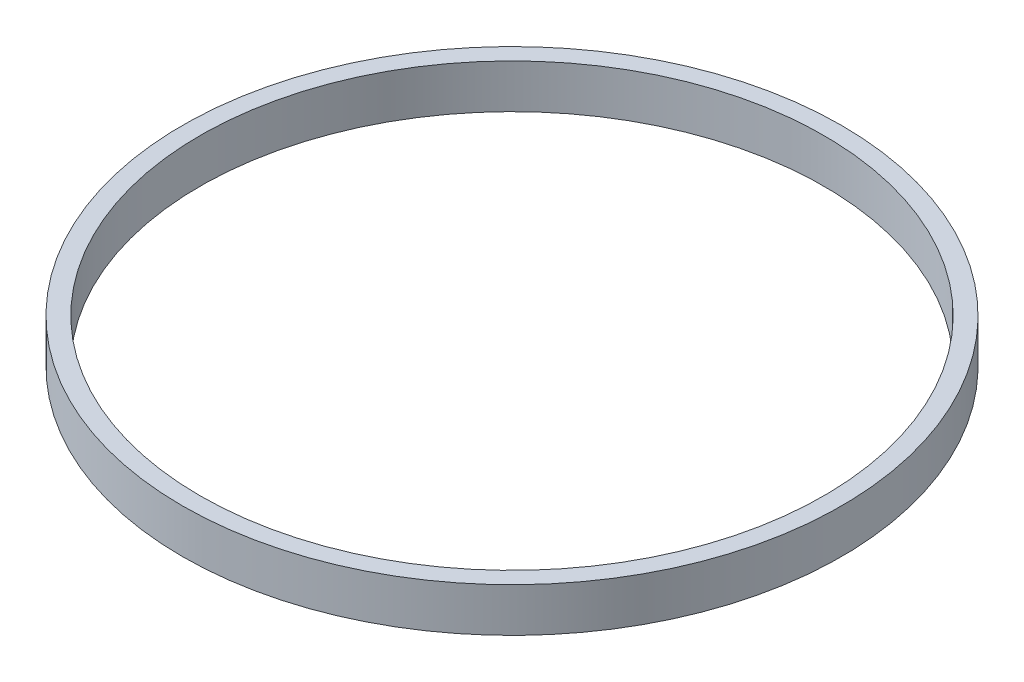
ISO-10303-21;
HEADER;
FILE_DESCRIPTION(('STEP AP214'),'2;1');
FILE_NAME('part.step','',(''),(''),'','','');
FILE_SCHEMA(('AUTOMOTIVE_DESIGN { 1 0 10303 214 1 1 1 1 }'));
ENDSEC;
DATA;
#1=APPLICATION_CONTEXT('core data for automotive mechanical design processes');
#2=APPLICATION_PROTOCOL_DEFINITION('international standard','automotive_design',2000,#1);
#3=PRODUCT_CONTEXT('',#1,'mechanical');
#4=PRODUCT('Part','Part','',(#3));
#5=PRODUCT_RELATED_PRODUCT_CATEGORY('part','',(#4));
#6=PRODUCT_DEFINITION_FORMATION('','',#4);
#7=PRODUCT_DEFINITION_CONTEXT('part definition',#1,'design');
#8=PRODUCT_DEFINITION('design','',#6,#7);
#9=PRODUCT_DEFINITION_SHAPE('','',#8);
#10=(LENGTH_UNIT() NAMED_UNIT(*) SI_UNIT(.MILLI.,.METRE.));
#11=(NAMED_UNIT(*) PLANE_ANGLE_UNIT() SI_UNIT($,.RADIAN.));
#12=(NAMED_UNIT(*) SI_UNIT($,.STERADIAN.) SOLID_ANGLE_UNIT());
#13=UNCERTAINTY_MEASURE_WITH_UNIT(LENGTH_MEASURE(1.E-05),#10,'distance_accuracy_value','');
#14=(GEOMETRIC_REPRESENTATION_CONTEXT(3) GLOBAL_UNCERTAINTY_ASSIGNED_CONTEXT((#13)) GLOBAL_UNIT_ASSIGNED_CONTEXT((#10,
#11,#12)) REPRESENTATION_CONTEXT('',''));
#15=CARTESIAN_POINT('',(0.,0.,0.));
#16=DIRECTION('',(0.,0.,1.));
#17=DIRECTION('',(1.,0.,0.));
#18=AXIS2_PLACEMENT_3D('',#15,#16,#17);
#19=CARTESIAN_POINT('',(0.,10.,0.));
#20=DIRECTION('',(0.,1.,0.));
#21=DIRECTION('',(0.,0.,1.));
#22=AXIS2_PLACEMENT_3D('',#19,#20,#21);
#23=PLANE('',#22);
#24=CARTESIAN_POINT('',(0.,10.,0.));
#25=DIRECTION('',(0.,1.,0.));
#26=DIRECTION('',(0.,0.,1.));
#27=AXIS2_PLACEMENT_3D('',#24,#25,#26);
#28=CIRCLE('',#27,75.);
#29=CARTESIAN_POINT('',(0.,10.,75.));
#30=VERTEX_POINT('',#29);
#31=EDGE_CURVE('E10',#30,#30,#28,.T.);
#32=ORIENTED_EDGE('',*,*,#31,.T.);
#33=EDGE_LOOP('',(#32));
#34=FACE_BOUND('',#33,.T.);
#35=CARTESIAN_POINT('',(0.,10.,0.));
#36=DIRECTION('',(0.,1.,0.));
#37=DIRECTION('',(0.,0.,1.));
#38=AXIS2_PLACEMENT_3D('',#35,#36,#37);
#39=CIRCLE('',#38,71.);
#40=CARTESIAN_POINT('',(0.,10.,71.));
#41=VERTEX_POINT('',#40);
#42=EDGE_CURVE('E45',#41,#41,#39,.T.);
#43=ORIENTED_EDGE('',*,*,#42,.F.);
#44=EDGE_LOOP('',(#43));
#45=FACE_BOUND('',#44,.T.);
#46=ADVANCED_FACE('F34',(#34,#45),#23,.T.);
#47=CARTESIAN_POINT('',(0.,0.,0.));
#48=DIRECTION('',(0.,1.,0.));
#49=DIRECTION('',(0.,0.,1.));
#50=AXIS2_PLACEMENT_3D('',#47,#48,#49);
#51=PLANE('',#50);
#52=CARTESIAN_POINT('',(0.,0.,0.));
#53=DIRECTION('',(0.,1.,0.));
#54=DIRECTION('',(0.,0.,1.));
#55=AXIS2_PLACEMENT_3D('',#52,#53,#54);
#56=CIRCLE('',#55,75.);
#57=CARTESIAN_POINT('',(0.,0.,75.));
#58=VERTEX_POINT('',#57);
#59=EDGE_CURVE('E38',#58,#58,#56,.T.);
#60=ORIENTED_EDGE('',*,*,#59,.F.);
#61=EDGE_LOOP('',(#60));
#62=FACE_BOUND('',#61,.T.);
#63=CARTESIAN_POINT('',(0.,0.,0.));
#64=DIRECTION('',(0.,1.,0.));
#65=DIRECTION('',(0.,0.,1.));
#66=AXIS2_PLACEMENT_3D('',#63,#64,#65);
#67=CIRCLE('',#66,71.);
#68=CARTESIAN_POINT('',(0.,0.,71.));
#69=VERTEX_POINT('',#68);
#70=EDGE_CURVE('E47',#69,#69,#67,.T.);
#71=ORIENTED_EDGE('',*,*,#70,.T.);
#72=EDGE_LOOP('',(#71));
#73=FACE_BOUND('',#72,.T.);
#74=ADVANCED_FACE('F57',(#62,#73),#51,.F.);
#75=CARTESIAN_POINT('',(0.,10.,0.));
#76=DIRECTION('',(0.,-1.,0.));
#77=DIRECTION('',(0.,0.,-1.));
#78=AXIS2_PLACEMENT_3D('',#75,#76,#77);
#79=CYLINDRICAL_SURFACE('',#78,75.);
#80=ORIENTED_EDGE('',*,*,#31,.F.);
#81=EDGE_LOOP('',(#80));
#82=FACE_BOUND('',#81,.T.);
#83=ORIENTED_EDGE('',*,*,#59,.T.);
#84=EDGE_LOOP('',(#83));
#85=FACE_BOUND('',#84,.T.);
#86=ADVANCED_FACE('F36',(#82,#85),#79,.T.);
#87=CARTESIAN_POINT('',(0.,10.,0.));
#88=DIRECTION('',(0.,-1.,0.));
#89=DIRECTION('',(0.,0.,-1.));
#90=AXIS2_PLACEMENT_3D('',#87,#88,#89);
#91=CYLINDRICAL_SURFACE('',#90,71.);
#92=ORIENTED_EDGE('',*,*,#42,.T.);
#93=EDGE_LOOP('',(#92));
#94=FACE_BOUND('',#93,.T.);
#95=ORIENTED_EDGE('',*,*,#70,.F.);
#96=EDGE_LOOP('',(#95));
#97=FACE_BOUND('',#96,.T.);
#98=ADVANCED_FACE('F53',(#94,#97),#91,.F.);
#99=CLOSED_SHELL('',(#46,#74,#86,#98));
#100=MANIFOLD_SOLID_BREP('B2',#99);
#101=ADVANCED_BREP_SHAPE_REPRESENTATION('',(#18,#100),#14);
#102=SHAPE_DEFINITION_REPRESENTATION(#9,#101);
ENDSEC;
END-ISO-10303-21;
